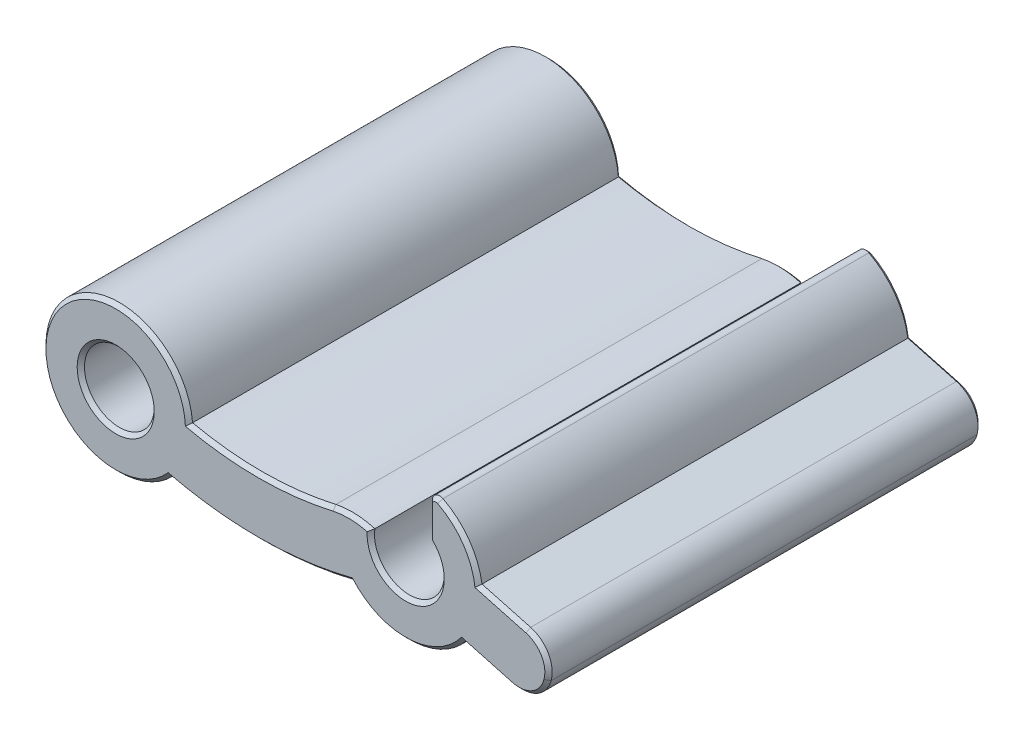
ISO-10303-21;
HEADER;
FILE_DESCRIPTION(('STEP AP214'),'2;1');
FILE_NAME('part.step','',(''),(''),'','','');
FILE_SCHEMA(('AUTOMOTIVE_DESIGN { 1 0 10303 214 1 1 1 1 }'));
ENDSEC;
DATA;
#1=APPLICATION_CONTEXT('core data for automotive mechanical design processes');
#2=APPLICATION_PROTOCOL_DEFINITION('international standard','automotive_design',2000,#1);
#3=PRODUCT_CONTEXT('',#1,'mechanical');
#4=PRODUCT('Part','Part','',(#3));
#5=PRODUCT_RELATED_PRODUCT_CATEGORY('part','',(#4));
#6=PRODUCT_DEFINITION_FORMATION('','',#4);
#7=PRODUCT_DEFINITION_CONTEXT('part definition',#1,'design');
#8=PRODUCT_DEFINITION('design','',#6,#7);
#9=PRODUCT_DEFINITION_SHAPE('','',#8);
#10=(LENGTH_UNIT() NAMED_UNIT(*) SI_UNIT(.MILLI.,.METRE.));
#11=(NAMED_UNIT(*) PLANE_ANGLE_UNIT() SI_UNIT($,.RADIAN.));
#12=(NAMED_UNIT(*) SI_UNIT($,.STERADIAN.) SOLID_ANGLE_UNIT());
#13=UNCERTAINTY_MEASURE_WITH_UNIT(LENGTH_MEASURE(1.E-05),#10,'distance_accuracy_value','');
#14=(GEOMETRIC_REPRESENTATION_CONTEXT(3) GLOBAL_UNCERTAINTY_ASSIGNED_CONTEXT((#13)) GLOBAL_UNIT_ASSIGNED_CONTEXT((#10,
#11,#12)) REPRESENTATION_CONTEXT('',''));
#15=CARTESIAN_POINT('',(0.,0.,0.));
#16=DIRECTION('',(0.,0.,1.));
#17=DIRECTION('',(1.,0.,0.));
#18=AXIS2_PLACEMENT_3D('',#15,#16,#17);
#19=CARTESIAN_POINT('',(66.3821386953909,-73.8159430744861,-23.6));
#20=DIRECTION('',(0.,0.,-1.));
#21=DIRECTION('',(-1.,0.,0.));
#22=AXIS2_PLACEMENT_3D('',#19,#20,#21);
#23=PLANE('',#22);
#24=CARTESIAN_POINT('',(58.60837752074,-91.5648192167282,-23.6));
#25=DIRECTION('',(0.,0.,-1.));
#26=DIRECTION('',(-1.,0.,0.));
#27=AXIS2_PLACEMENT_3D('',#24,#25,#26);
#28=CIRCLE('',#27,2.09999999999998);
#29=CARTESIAN_POINT('',(56.5083775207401,-91.5648192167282,-23.6));
#30=VERTEX_POINT('',#29);
#31=EDGE_CURVE('E11',#30,#30,#28,.F.);
#32=ORIENTED_EDGE('',*,*,#31,.T.);
#33=EDGE_LOOP('',(#32));
#34=FACE_BOUND('',#33,.T.);
#35=CARTESIAN_POINT('',(74.40837752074,-91.5648192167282,-23.6));
#36=DIRECTION('',(0.,0.,-1.));
#37=DIRECTION('',(-1.,0.,0.));
#38=AXIS2_PLACEMENT_3D('',#35,#36,#37);
#39=CIRCLE('',#38,2.1);
#40=CARTESIAN_POINT('',(72.3126935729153,-91.4302503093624,-23.6));
#41=VERTEX_POINT('',#40);
#42=CARTESIAN_POINT('',(75.8583775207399,-90.0457734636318,-23.6));
#43=VERTEX_POINT('',#42);
#44=EDGE_CURVE('E792',#41,#43,#39,.F.);
#45=ORIENTED_EDGE('',*,*,#44,.T.);
#46=DIRECTION('',(0.,1.,0.));
#47=VECTOR('',#46,1.);
#48=CARTESIAN_POINT('',(75.85837752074,-88.365209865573,-23.6));
#49=LINE('',#48,#47);
#50=CARTESIAN_POINT('',(75.85837752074,-88.365209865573,-23.6));
#51=VERTEX_POINT('',#50);
#52=EDGE_CURVE('E62',#43,#51,#49,.T.);
#53=ORIENTED_EDGE('',*,*,#52,.T.);
#54=CARTESIAN_POINT('',(76.05837752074,-88.365209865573,-23.6));
#55=DIRECTION('',(0.,0.,-1.));
#56=DIRECTION('',(-1.,0.,0.));
#57=AXIS2_PLACEMENT_3D('',#54,#55,#56);
#58=CIRCLE('',#57,0.199999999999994);
#59=CARTESIAN_POINT('',(76.1500441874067,-88.1874537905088,-23.6));
#60=VERTEX_POINT('',#59);
#61=EDGE_CURVE('E77',#51,#60,#58,.T.);
#62=ORIENTED_EDGE('',*,*,#61,.T.);
#63=CARTESIAN_POINT('',(74.40837752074,-91.5648192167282,-23.6));
#64=DIRECTION('',(0.,0.,-1.));
#65=DIRECTION('',(-1.,0.,0.));
#66=AXIS2_PLACEMENT_3D('',#63,#64,#65);
#67=CIRCLE('',#66,3.79999999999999);
#68=CARTESIAN_POINT('',(78.1839900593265,-91.1349937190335,-23.6));
#69=VERTEX_POINT('',#68);
#70=EDGE_CURVE('E807',#60,#69,#67,.T.);
#71=ORIENTED_EDGE('',*,*,#70,.T.);
#72=DIRECTION('',(0.965365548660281,-0.260901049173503,0.));
#73=VECTOR('',#72,1.);
#74=CARTESIAN_POINT('',(80.9616321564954,-91.8856831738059,-23.6));
#75=LINE('',#74,#73);
#76=CARTESIAN_POINT('',(80.9616321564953,-91.8856831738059,-23.6));
#77=VERTEX_POINT('',#76);
#78=EDGE_CURVE('E804',#69,#77,#75,.T.);
#79=ORIENTED_EDGE('',*,*,#78,.T.);
#80=CARTESIAN_POINT('',(80.5989796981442,-93.2275412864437,-23.6));
#81=DIRECTION('',(0.,0.,-1.));
#82=DIRECTION('',(-1.,0.,0.));
#83=AXIS2_PLACEMENT_3D('',#80,#81,#82);
#84=CIRCLE('',#83,1.39);
#85=CARTESIAN_POINT('',(81.940837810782,-93.5901937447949,-23.6));
#86=VERTEX_POINT('',#85);
#87=EDGE_CURVE('E801',#77,#86,#84,.T.);
#88=ORIENTED_EDGE('',*,*,#87,.T.);
#89=DIRECTION('',(-0.260901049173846,-0.965365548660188,0.));
#90=VECTOR('',#89,1.);
#91=CARTESIAN_POINT('',(81.9356197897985,-93.609501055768,-23.6));
#92=LINE('',#91,#90);
#93=CARTESIAN_POINT('',(81.9356197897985,-93.609501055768,-23.6));
#94=VERTEX_POINT('',#93);
#95=EDGE_CURVE('E798',#86,#94,#92,.T.);
#96=ORIENTED_EDGE('',*,*,#95,.T.);
#97=CARTESIAN_POINT('',(80.5937616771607,-93.2468485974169,-23.6));
#98=DIRECTION('',(0.,0.,-1.));
#99=DIRECTION('',(-1.,0.,0.));
#100=AXIS2_PLACEMENT_3D('',#97,#98,#99);
#101=CIRCLE('',#100,1.38999999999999);
#102=CARTESIAN_POINT('',(80.2311092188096,-94.5887067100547,-23.6));
#103=VERTEX_POINT('',#102);
#104=EDGE_CURVE('E795',#94,#103,#101,.T.);
#105=ORIENTED_EDGE('',*,*,#104,.T.);
#106=DIRECTION('',(-0.965365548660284,0.260901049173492,0.));
#107=VECTOR('',#106,1.);
#108=CARTESIAN_POINT('',(77.5822046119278,-93.8728100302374,-23.6));
#109=LINE('',#108,#107);
#110=CARTESIAN_POINT('',(77.4534671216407,-93.8380172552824,-23.6));
#111=VERTEX_POINT('',#110);
#112=EDGE_CURVE('E786',#103,#111,#109,.T.);
#113=ORIENTED_EDGE('',*,*,#112,.T.);
#114=CARTESIAN_POINT('',(74.40837752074,-91.5648192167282,-23.6));
#115=DIRECTION('',(0.,0.,-1.));
#116=DIRECTION('',(-1.,0.,0.));
#117=AXIS2_PLACEMENT_3D('',#114,#115,#116);
#118=CIRCLE('',#117,3.79999999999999);
#119=CARTESIAN_POINT('',(71.5069788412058,-94.0187722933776,-23.6));
#120=VERTEX_POINT('',#119);
#121=EDGE_CURVE('E281',#111,#120,#118,.T.);
#122=ORIENTED_EDGE('',*,*,#121,.T.);
#123=CARTESIAN_POINT('',(66.3821386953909,-73.8159430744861,-23.6));
#124=DIRECTION('',(0.,0.,-1.));
#125=DIRECTION('',(-1.,0.,0.));
#126=AXIS2_PLACEMENT_3D('',#123,#124,#125);
#127=CIRCLE('',#126,20.8427036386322);
#128=CARTESIAN_POINT('',(61.465309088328,-94.0704013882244,-23.6));
#129=VERTEX_POINT('',#128);
#130=EDGE_CURVE('E781',#120,#129,#127,.T.);
#131=ORIENTED_EDGE('',*,*,#130,.T.);
#132=CARTESIAN_POINT('',(58.60837752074,-91.5648192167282,-23.6));
#133=DIRECTION('',(0.,0.,-1.));
#134=DIRECTION('',(-1.,0.,0.));
#135=AXIS2_PLACEMENT_3D('',#132,#133,#134);
#136=CIRCLE('',#135,3.80000000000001);
#137=CARTESIAN_POINT('',(62.4054208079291,-91.4149450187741,-23.6));
#138=VERTEX_POINT('',#137);
#139=EDGE_CURVE('E778',#129,#138,#136,.T.);
#140=ORIENTED_EDGE('',*,*,#139,.T.);
#141=CARTESIAN_POINT('',(66.3821386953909,-73.8159430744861,-23.6));
#142=DIRECTION('',(0.,0.,-1.));
#143=DIRECTION('',(-1.,0.,0.));
#144=AXIS2_PLACEMENT_3D('',#141,#142,#143);
#145=CIRCLE('',#144,18.0427036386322);
#146=CARTESIAN_POINT('',(70.4513630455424,-91.3937861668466,-23.6));
#147=VERTEX_POINT('',#146);
#148=EDGE_CURVE('E775',#138,#147,#145,.F.);
#149=ORIENTED_EDGE('',*,*,#148,.T.);
#150=CARTESIAN_POINT('',(71.3023640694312,-95.478519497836,-23.6));
#151=DIRECTION('',(0.,0.,-1.));
#152=DIRECTION('',(-1.,0.,0.));
#153=AXIS2_PLACEMENT_3D('',#150,#151,#152);
#154=CIRCLE('',#153,4.17243922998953);
#155=EDGE_CURVE('E789',#147,#41,#154,.T.);
#156=ORIENTED_EDGE('',*,*,#155,.T.);
#157=EDGE_LOOP('',(#45,#53,#62,#71,#79,#88,#96,#105,#113,#122,#131,#140,#149,#156));
#158=FACE_BOUND('',#157,.T.);
#159=ADVANCED_FACE('F45',(#34,#158),#23,.T.);
#160=CARTESIAN_POINT('',(66.3821386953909,-73.8159430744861,0.));
#161=DIRECTION('',(0.,0.,-1.));
#162=DIRECTION('',(-1.,0.,0.));
#163=AXIS2_PLACEMENT_3D('',#160,#161,#162);
#164=PLANE('',#163);
#165=CARTESIAN_POINT('',(74.40837752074,-91.5648192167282,0.));
#166=DIRECTION('',(0.,0.,-1.));
#167=DIRECTION('',(-1.,0.,0.));
#168=AXIS2_PLACEMENT_3D('',#165,#166,#167);
#169=CIRCLE('',#168,3.8);
#170=CARTESIAN_POINT('',(71.5069788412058,-94.0187722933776,0.));
#171=VERTEX_POINT('',#170);
#172=CARTESIAN_POINT('',(77.4534671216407,-93.8380172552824,0.));
#173=VERTEX_POINT('',#172);
#174=EDGE_CURVE('E876',#171,#173,#169,.F.);
#175=ORIENTED_EDGE('',*,*,#174,.T.);
#176=DIRECTION('',(0.965365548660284,-0.260901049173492,0.));
#177=VECTOR('',#176,1.);
#178=CARTESIAN_POINT('',(62.092899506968,-89.6866486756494,0.));
#179=LINE('',#178,#177);
#180=CARTESIAN_POINT('',(80.2311092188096,-94.5887067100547,0.));
#181=VERTEX_POINT('',#180);
#182=EDGE_CURVE('E691',#173,#181,#179,.T.);
#183=ORIENTED_EDGE('',*,*,#182,.T.);
#184=CARTESIAN_POINT('',(80.5937616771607,-93.2468485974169,0.));
#185=DIRECTION('',(0.,0.,-1.));
#186=DIRECTION('',(-1.,0.,0.));
#187=AXIS2_PLACEMENT_3D('',#184,#185,#186);
#188=CIRCLE('',#187,1.39000000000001);
#189=CARTESIAN_POINT('',(81.9356197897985,-93.6095010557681,0.));
#190=VERTEX_POINT('',#189);
#191=EDGE_CURVE('E688',#181,#190,#188,.F.);
#192=ORIENTED_EDGE('',*,*,#191,.T.);
#193=DIRECTION('',(0.260901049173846,0.965365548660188,0.));
#194=VECTOR('',#193,1.);
#195=CARTESIAN_POINT('',(85.8622065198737,-79.0806535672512,0.));
#196=LINE('',#195,#194);
#197=CARTESIAN_POINT('',(81.940837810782,-93.5901937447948,0.));
#198=VERTEX_POINT('',#197);
#199=EDGE_CURVE('E685',#190,#198,#196,.T.);
#200=ORIENTED_EDGE('',*,*,#199,.T.);
#201=CARTESIAN_POINT('',(80.5989796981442,-93.2275412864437,0.));
#202=DIRECTION('',(0.,0.,-1.));
#203=DIRECTION('',(-1.,0.,0.));
#204=AXIS2_PLACEMENT_3D('',#201,#202,#203);
#205=CIRCLE('',#204,1.39);
#206=CARTESIAN_POINT('',(80.9616321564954,-91.8856831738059,0.));
#207=VERTEX_POINT('',#206);
#208=EDGE_CURVE('E677',#198,#207,#205,.F.);
#209=ORIENTED_EDGE('',*,*,#208,.T.);
#210=DIRECTION('',(-0.965365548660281,0.260901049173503,0.));
#211=VECTOR('',#210,1.);
#212=CARTESIAN_POINT('',(62.8234224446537,-86.9836251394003,0.));
#213=LINE('',#212,#211);
#214=CARTESIAN_POINT('',(78.1839900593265,-91.1349937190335,0.));
#215=VERTEX_POINT('',#214);
#216=EDGE_CURVE('E662',#207,#215,#213,.T.);
#217=ORIENTED_EDGE('',*,*,#216,.T.);
#218=CARTESIAN_POINT('',(74.40837752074,-91.5648192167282,0.));
#219=DIRECTION('',(0.,0.,-1.));
#220=DIRECTION('',(-1.,0.,0.));
#221=AXIS2_PLACEMENT_3D('',#218,#219,#220);
#222=CIRCLE('',#221,3.8);
#223=CARTESIAN_POINT('',(76.1500441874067,-88.1874537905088,0.));
#224=VERTEX_POINT('',#223);
#225=EDGE_CURVE('E669',#215,#224,#222,.F.);
#226=ORIENTED_EDGE('',*,*,#225,.T.);
#227=CARTESIAN_POINT('',(76.05837752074,-88.365209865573,0.));
#228=DIRECTION('',(0.,0.,-1.));
#229=DIRECTION('',(-1.,0.,0.));
#230=AXIS2_PLACEMENT_3D('',#227,#228,#229);
#231=CIRCLE('',#230,0.199999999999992);
#232=CARTESIAN_POINT('',(75.85837752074,-88.365209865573,0.));
#233=VERTEX_POINT('',#232);
#234=EDGE_CURVE('E673',#224,#233,#231,.F.);
#235=ORIENTED_EDGE('',*,*,#234,.T.);
#236=DIRECTION('',(0.,-1.,0.));
#237=VECTOR('',#236,1.);
#238=CARTESIAN_POINT('',(75.85837752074,-73.8159430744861,0.));
#239=LINE('',#238,#237);
#240=CARTESIAN_POINT('',(75.8583775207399,-90.0457734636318,0.));
#241=VERTEX_POINT('',#240);
#242=EDGE_CURVE('E679',#233,#241,#239,.T.);
#243=ORIENTED_EDGE('',*,*,#242,.T.);
#244=CARTESIAN_POINT('',(74.40837752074,-91.5648192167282,0.));
#245=DIRECTION('',(0.,0.,-1.));
#246=DIRECTION('',(-1.,0.,0.));
#247=AXIS2_PLACEMENT_3D('',#244,#245,#246);
#248=CIRCLE('',#247,2.1);
#249=CARTESIAN_POINT('',(72.3126935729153,-91.4302503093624,0.));
#250=VERTEX_POINT('',#249);
#251=EDGE_CURVE('E873',#241,#250,#248,.T.);
#252=ORIENTED_EDGE('',*,*,#251,.T.);
#253=CARTESIAN_POINT('',(71.3023640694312,-95.478519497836,0.));
#254=DIRECTION('',(0.,0.,-1.));
#255=DIRECTION('',(-1.,0.,0.));
#256=AXIS2_PLACEMENT_3D('',#253,#254,#255);
#257=CIRCLE('',#256,4.17243922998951);
#258=CARTESIAN_POINT('',(70.4513630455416,-91.3937861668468,0.));
#259=VERTEX_POINT('',#258);
#260=EDGE_CURVE('E870',#250,#259,#257,.F.);
#261=ORIENTED_EDGE('',*,*,#260,.T.);
#262=CARTESIAN_POINT('',(66.3821386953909,-73.8159430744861,0.));
#263=DIRECTION('',(0.,0.,-1.));
#264=DIRECTION('',(-1.,0.,0.));
#265=AXIS2_PLACEMENT_3D('',#262,#263,#264);
#266=CIRCLE('',#265,18.0427036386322);
#267=CARTESIAN_POINT('',(62.4054208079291,-91.4149450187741,0.));
#268=VERTEX_POINT('',#267);
#269=EDGE_CURVE('E864',#259,#268,#266,.T.);
#270=ORIENTED_EDGE('',*,*,#269,.T.);
#271=CARTESIAN_POINT('',(58.60837752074,-91.5648192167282,0.));
#272=DIRECTION('',(0.,0.,-1.));
#273=DIRECTION('',(-1.,0.,0.));
#274=AXIS2_PLACEMENT_3D('',#271,#272,#273);
#275=CIRCLE('',#274,3.8);
#276=CARTESIAN_POINT('',(61.465309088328,-94.0704013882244,0.));
#277=VERTEX_POINT('',#276);
#278=EDGE_CURVE('E861',#268,#277,#275,.F.);
#279=ORIENTED_EDGE('',*,*,#278,.T.);
#280=CARTESIAN_POINT('',(66.3821386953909,-73.8159430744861,0.));
#281=DIRECTION('',(0.,0.,-1.));
#282=DIRECTION('',(-1.,0.,0.));
#283=AXIS2_PLACEMENT_3D('',#280,#281,#282);
#284=CIRCLE('',#283,20.8427036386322);
#285=EDGE_CURVE('E867',#277,#171,#284,.F.);
#286=ORIENTED_EDGE('',*,*,#285,.T.);
#287=EDGE_LOOP('',(#175,#183,#192,#200,#209,#217,#226,#235,#243,#252,#261,#270,#279,#286));
#288=FACE_BOUND('',#287,.T.);
#289=CARTESIAN_POINT('',(58.60837752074,-91.5648192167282,0.));
#290=DIRECTION('',(0.,0.,-1.));
#291=DIRECTION('',(-1.,0.,0.));
#292=AXIS2_PLACEMENT_3D('',#289,#290,#291);
#293=CIRCLE('',#292,2.1);
#294=CARTESIAN_POINT('',(56.50837752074,-91.5648192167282,0.));
#295=VERTEX_POINT('',#294);
#296=EDGE_CURVE('E857',#295,#295,#293,.T.);
#297=ORIENTED_EDGE('',*,*,#296,.T.);
#298=EDGE_LOOP('',(#297));
#299=FACE_BOUND('',#298,.T.);
#300=ADVANCED_FACE('F475',(#288,#299),#164,.F.);
#301=CARTESIAN_POINT('',(66.3821386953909,-73.8159430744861,-23.6));
#302=DIRECTION('',(0.,0.,1.));
#303=DIRECTION('',(1.,0.,0.));
#304=AXIS2_PLACEMENT_3D('',#301,#302,#303);
#305=CYLINDRICAL_SURFACE('',#304,21.0427036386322);
#306=DIRECTION('',(0.,0.,1.));
#307=VECTOR('',#306,1.);
#308=CARTESIAN_POINT('',(71.4368619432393,-94.242522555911,-23.6));
#309=LINE('',#308,#307);
#310=CARTESIAN_POINT('',(71.4368619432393,-94.242522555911,-23.4));
#311=VERTEX_POINT('',#310);
#312=CARTESIAN_POINT('',(71.4368619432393,-94.242522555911,-0.200000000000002));
#313=VERTEX_POINT('',#312);
#314=EDGE_CURVE('E248',#311,#313,#309,.T.);
#315=ORIENTED_EDGE('',*,*,#314,.T.);
#316=CARTESIAN_POINT('',(66.3821386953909,-73.8159430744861,-0.200000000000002));
#317=DIRECTION('',(0.,0.,-1.));
#318=DIRECTION('',(-1.,0.,0.));
#319=AXIS2_PLACEMENT_3D('',#316,#317,#318);
#320=CIRCLE('',#319,21.0427036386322);
#321=CARTESIAN_POINT('',(61.5340398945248,-94.2925471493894,-0.200000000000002));
#322=VERTEX_POINT('',#321);
#323=EDGE_CURVE('E752',#313,#322,#320,.T.);
#324=ORIENTED_EDGE('',*,*,#323,.T.);
#325=DIRECTION('',(0.,0.,1.));
#326=VECTOR('',#325,1.);
#327=CARTESIAN_POINT('',(61.5340398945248,-94.2925471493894,-23.6));
#328=LINE('',#327,#326);
#329=CARTESIAN_POINT('',(61.5340398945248,-94.2925471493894,-23.4));
#330=VERTEX_POINT('',#329);
#331=EDGE_CURVE('E845',#330,#322,#328,.T.);
#332=ORIENTED_EDGE('',*,*,#331,.F.);
#333=CARTESIAN_POINT('',(66.3821386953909,-73.8159430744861,-23.4));
#334=DIRECTION('',(0.,0.,-1.));
#335=DIRECTION('',(-1.,0.,0.));
#336=AXIS2_PLACEMENT_3D('',#333,#334,#335);
#337=CIRCLE('',#336,21.0427036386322);
#338=EDGE_CURVE('E749',#330,#311,#337,.F.);
#339=ORIENTED_EDGE('',*,*,#338,.T.);
#340=EDGE_LOOP('',(#315,#324,#332,#339));
#341=FACE_BOUND('',#340,.T.);
#342=ADVANCED_FACE('F481',(#341),#305,.T.);
#343=CARTESIAN_POINT('',(58.60837752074,-91.5648192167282,-23.6));
#344=DIRECTION('',(0.,0.,1.));
#345=DIRECTION('',(1.,0.,0.));
#346=AXIS2_PLACEMENT_3D('',#343,#344,#345);
#347=CYLINDRICAL_SURFACE('',#346,4.00000000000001);
#348=ORIENTED_EDGE('',*,*,#331,.T.);
#349=CARTESIAN_POINT('',(58.60837752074,-91.5648192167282,-0.200000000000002));
#350=DIRECTION('',(0.,0.,-1.));
#351=DIRECTION('',(-1.,0.,0.));
#352=AXIS2_PLACEMENT_3D('',#349,#350,#351);
#353=CIRCLE('',#352,4.00000000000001);
#354=CARTESIAN_POINT('',(62.5961544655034,-91.2523531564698,-0.200000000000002));
#355=VERTEX_POINT('',#354);
#356=EDGE_CURVE('E764',#322,#355,#353,.T.);
#357=ORIENTED_EDGE('',*,*,#356,.T.);
#358=DIRECTION('',(0.,0.,1.));
#359=VECTOR('',#358,1.);
#360=CARTESIAN_POINT('',(62.5961544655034,-91.2523531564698,-23.6));
#361=LINE('',#360,#359);
#362=CARTESIAN_POINT('',(62.5961544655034,-91.2523531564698,-23.4));
#363=VERTEX_POINT('',#362);
#364=EDGE_CURVE('E841',#363,#355,#361,.T.);
#365=ORIENTED_EDGE('',*,*,#364,.F.);
#366=CARTESIAN_POINT('',(58.60837752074,-91.5648192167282,-23.4));
#367=DIRECTION('',(0.,0.,-1.));
#368=DIRECTION('',(-1.,0.,0.));
#369=AXIS2_PLACEMENT_3D('',#366,#367,#368);
#370=CIRCLE('',#369,4.00000000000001);
#371=EDGE_CURVE('E761',#363,#330,#370,.F.);
#372=ORIENTED_EDGE('',*,*,#371,.T.);
#373=EDGE_LOOP('',(#348,#357,#365,#372));
#374=FACE_BOUND('',#373,.T.);
#375=ADVANCED_FACE('F526',(#374),#347,.T.);
#376=CARTESIAN_POINT('',(66.3821386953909,-73.8159430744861,-23.6));
#377=DIRECTION('',(0.,0.,1.));
#378=DIRECTION('',(1.,0.,0.));
#379=AXIS2_PLACEMENT_3D('',#376,#377,#378);
#380=CYLINDRICAL_SURFACE('',#379,17.8427036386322);
#381=ORIENTED_EDGE('',*,*,#364,.T.);
#382=CARTESIAN_POINT('',(66.3821386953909,-73.8159430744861,-0.200000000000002));
#383=DIRECTION('',(0.,0.,-1.));
#384=DIRECTION('',(-1.,0.,0.));
#385=AXIS2_PLACEMENT_3D('',#382,#383,#384);
#386=CIRCLE('',#385,17.8427036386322);
#387=CARTESIAN_POINT('',(70.40837752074,-91.1984479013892,-0.200000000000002));
#388=VERTEX_POINT('',#387);
#389=EDGE_CURVE('E758',#355,#388,#386,.F.);
#390=ORIENTED_EDGE('',*,*,#389,.T.);
#391=DIRECTION('',(0.,0.,1.));
#392=VECTOR('',#391,1.);
#393=CARTESIAN_POINT('',(70.40837752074,-91.1984479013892,-23.6));
#394=LINE('',#393,#392);
#395=CARTESIAN_POINT('',(70.40837752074,-91.1984479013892,-23.4));
#396=VERTEX_POINT('',#395);
#397=EDGE_CURVE('E831',#396,#388,#394,.T.);
#398=ORIENTED_EDGE('',*,*,#397,.F.);
#399=CARTESIAN_POINT('',(66.3821386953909,-73.8159430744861,-23.4));
#400=DIRECTION('',(0.,0.,-1.));
#401=DIRECTION('',(-1.,0.,0.));
#402=AXIS2_PLACEMENT_3D('',#399,#400,#401);
#403=CIRCLE('',#402,17.8427036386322);
#404=EDGE_CURVE('E755',#396,#363,#403,.T.);
#405=ORIENTED_EDGE('',*,*,#404,.T.);
#406=EDGE_LOOP('',(#381,#390,#398,#405));
#407=FACE_BOUND('',#406,.T.);
#408=ADVANCED_FACE('F522',(#407),#380,.F.);
#409=CARTESIAN_POINT('',(71.3023640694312,-95.478519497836,-23.6));
#410=DIRECTION('',(0.,0.,1.));
#411=DIRECTION('',(1.,0.,0.));
#412=AXIS2_PLACEMENT_3D('',#409,#410,#411);
#413=CYLINDRICAL_SURFACE('',#412,4.37243922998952);
#414=ORIENTED_EDGE('',*,*,#397,.T.);
#415=CARTESIAN_POINT('',(71.3023640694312,-95.478519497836,-0.200000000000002));
#416=DIRECTION('',(0.,0.,-1.));
#417=DIRECTION('',(-1.,0.,0.));
#418=AXIS2_PLACEMENT_3D('',#415,#416,#417);
#419=CIRCLE('',#418,4.37243922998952);
#420=CARTESIAN_POINT('',(72.5295699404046,-91.2818314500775,-0.200000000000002));
#421=VERTEX_POINT('',#420);
#422=EDGE_CURVE('E746',#388,#421,#419,.T.);
#423=ORIENTED_EDGE('',*,*,#422,.T.);
#424=DIRECTION('',(0.,0.,1.));
#425=VECTOR('',#424,1.);
#426=CARTESIAN_POINT('',(72.5295699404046,-91.2818314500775,-23.6));
#427=LINE('',#426,#425);
#428=CARTESIAN_POINT('',(72.5295699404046,-91.2818314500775,-23.4));
#429=VERTEX_POINT('',#428);
#430=EDGE_CURVE('E826',#429,#421,#427,.T.);
#431=ORIENTED_EDGE('',*,*,#430,.F.);
#432=CARTESIAN_POINT('',(71.3023640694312,-95.478519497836,-23.4));
#433=DIRECTION('',(0.,0.,-1.));
#434=DIRECTION('',(-1.,0.,0.));
#435=AXIS2_PLACEMENT_3D('',#432,#433,#434);
#436=CIRCLE('',#435,4.37243922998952);
#437=EDGE_CURVE('E743',#429,#396,#436,.F.);
#438=ORIENTED_EDGE('',*,*,#437,.T.);
#439=EDGE_LOOP('',(#414,#423,#431,#438));
#440=FACE_BOUND('',#439,.T.);
#441=ADVANCED_FACE('F518',(#440),#413,.T.);
#442=CARTESIAN_POINT('',(74.40837752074,-91.5648192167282,-23.6));
#443=DIRECTION('',(0.,0.,1.));
#444=DIRECTION('',(1.,0.,0.));
#445=AXIS2_PLACEMENT_3D('',#442,#443,#444);
#446=CYLINDRICAL_SURFACE('',#445,1.9);
#447=ORIENTED_EDGE('',*,*,#430,.T.);
#448=CARTESIAN_POINT('',(74.40837752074,-91.5648192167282,-0.200000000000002));
#449=DIRECTION('',(0.,0.,-1.));
#450=DIRECTION('',(-1.,0.,0.));
#451=AXIS2_PLACEMENT_3D('',#448,#449,#450);
#452=CIRCLE('',#451,1.9);
#453=CARTESIAN_POINT('',(75.65837752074,-90.1339104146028,-0.200000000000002));
#454=VERTEX_POINT('',#453);
#455=EDGE_CURVE('E740',#421,#454,#452,.F.);
#456=ORIENTED_EDGE('',*,*,#455,.T.);
#457=DIRECTION('',(0.,0.,1.));
#458=VECTOR('',#457,1.);
#459=CARTESIAN_POINT('',(75.65837752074,-90.1339104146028,-23.6));
#460=LINE('',#459,#458);
#461=CARTESIAN_POINT('',(75.65837752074,-90.1339104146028,-23.4));
#462=VERTEX_POINT('',#461);
#463=EDGE_CURVE('E821',#462,#454,#460,.T.);
#464=ORIENTED_EDGE('',*,*,#463,.F.);
#465=CARTESIAN_POINT('',(74.40837752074,-91.5648192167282,-23.4));
#466=DIRECTION('',(0.,0.,-1.));
#467=DIRECTION('',(-1.,0.,0.));
#468=AXIS2_PLACEMENT_3D('',#465,#466,#467);
#469=CIRCLE('',#468,1.9);
#470=EDGE_CURVE('E737',#462,#429,#469,.T.);
#471=ORIENTED_EDGE('',*,*,#470,.T.);
#472=EDGE_LOOP('',(#447,#456,#464,#471));
#473=FACE_BOUND('',#472,.T.);
#474=ADVANCED_FACE('F514',(#473),#446,.F.);
#475=CARTESIAN_POINT('',(75.65837752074,-87.7651481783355,-23.6));
#476=DIRECTION('',(1.,0.,0.));
#477=DIRECTION('',(0.,0.,-1.));
#478=AXIS2_PLACEMENT_3D('',#475,#476,#477);
#479=PLANE('',#478);
#480=ORIENTED_EDGE('',*,*,#463,.T.);
#481=DIRECTION('',(0.,1.,0.));
#482=VECTOR('',#481,1.);
#483=CARTESIAN_POINT('',(75.65837752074,-87.7651481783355,-0.200000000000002));
#484=LINE('',#483,#482);
#485=CARTESIAN_POINT('',(75.65837752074,-88.365209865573,-0.200000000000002));
#486=VERTEX_POINT('',#485);
#487=EDGE_CURVE('E255',#454,#486,#484,.T.);
#488=ORIENTED_EDGE('',*,*,#487,.T.);
#489=DIRECTION('',(0.,0.,1.));
#490=VECTOR('',#489,1.);
#491=CARTESIAN_POINT('',(75.65837752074,-88.365209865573,-23.6));
#492=LINE('',#491,#490);
#493=CARTESIAN_POINT('',(75.65837752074,-88.365209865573,-23.4));
#494=VERTEX_POINT('',#493);
#495=EDGE_CURVE('E278',#486,#494,#492,.F.);
#496=ORIENTED_EDGE('',*,*,#495,.T.);
#497=DIRECTION('',(0.,-1.,0.));
#498=VECTOR('',#497,1.);
#499=CARTESIAN_POINT('',(75.65837752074,-90.1339104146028,-23.4));
#500=LINE('',#499,#498);
#501=EDGE_CURVE('E729',#494,#462,#500,.T.);
#502=ORIENTED_EDGE('',*,*,#501,.T.);
#503=EDGE_LOOP('',(#480,#488,#496,#502));
#504=FACE_BOUND('',#503,.T.);
#505=ADVANCED_FACE('F510',(#504),#479,.F.);
#506=CARTESIAN_POINT('',(74.40837752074,-91.5648192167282,-23.6));
#507=DIRECTION('',(0.,0.,1.));
#508=DIRECTION('',(1.,0.,0.));
#509=AXIS2_PLACEMENT_3D('',#506,#507,#508);
#510=CYLINDRICAL_SURFACE('',#509,4.);
#511=DIRECTION('',(0.,0.,1.));
#512=VECTOR('',#511,1.);
#513=CARTESIAN_POINT('',(76.2417108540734,-88.0096977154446,-23.6));
#514=LINE('',#513,#512);
#515=CARTESIAN_POINT('',(76.2417108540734,-88.0096977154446,-23.4));
#516=VERTEX_POINT('',#515);
#517=CARTESIAN_POINT('',(76.2417108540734,-88.0096977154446,-0.200000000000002));
#518=VERTEX_POINT('',#517);
#519=EDGE_CURVE('E849',#516,#518,#514,.T.);
#520=ORIENTED_EDGE('',*,*,#519,.T.);
#521=CARTESIAN_POINT('',(74.40837752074,-91.5648192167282,-0.200000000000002));
#522=DIRECTION('',(0.,0.,-1.));
#523=DIRECTION('',(-1.,0.,0.));
#524=AXIS2_PLACEMENT_3D('',#521,#522,#523);
#525=CIRCLE('',#524,4.);
#526=CARTESIAN_POINT('',(78.3649077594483,-90.9767133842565,-0.200000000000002));
#527=VERTEX_POINT('',#526);
#528=EDGE_CURVE('E668',#518,#527,#525,.T.);
#529=ORIENTED_EDGE('',*,*,#528,.T.);
#530=DIRECTION('',(0.,0.,1.));
#531=VECTOR('',#530,1.);
#532=CARTESIAN_POINT('',(78.3649077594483,-90.9767133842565,-23.6));
#533=LINE('',#532,#531);
#534=CARTESIAN_POINT('',(78.3649077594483,-90.9767133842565,-23.4));
#535=VERTEX_POINT('',#534);
#536=EDGE_CURVE('E827',#535,#527,#533,.T.);
#537=ORIENTED_EDGE('',*,*,#536,.F.);
#538=CARTESIAN_POINT('',(74.40837752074,-91.5648192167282,-23.4));
#539=DIRECTION('',(0.,0.,-1.));
#540=DIRECTION('',(-1.,0.,0.));
#541=AXIS2_PLACEMENT_3D('',#538,#539,#540);
#542=CIRCLE('',#541,4.);
#543=EDGE_CURVE('E718',#535,#516,#542,.F.);
#544=ORIENTED_EDGE('',*,*,#543,.T.);
#545=EDGE_LOOP('',(#520,#529,#537,#544));
#546=FACE_BOUND('',#545,.T.);
#547=ADVANCED_FACE('F506',(#546),#510,.T.);
#548=CARTESIAN_POINT('',(81.01381236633,-91.6926100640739,-23.6));
#549=DIRECTION('',(-0.260901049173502,-0.965365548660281,0.));
#550=DIRECTION('',(0.965365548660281,-0.260901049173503,0.));
#551=AXIS2_PLACEMENT_3D('',#548,#549,#550);
#552=PLANE('',#551);
#553=ORIENTED_EDGE('',*,*,#536,.T.);
#554=DIRECTION('',(0.965365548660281,-0.260901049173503,0.));
#555=VECTOR('',#554,1.);
#556=CARTESIAN_POINT('',(81.01381236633,-91.6926100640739,-0.199999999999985));
#557=LINE('',#556,#555);
#558=CARTESIAN_POINT('',(81.01381236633,-91.6926100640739,-0.199999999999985));
#559=VERTEX_POINT('',#558);
#560=EDGE_CURVE('E664',#527,#559,#557,.T.);
#561=ORIENTED_EDGE('',*,*,#560,.T.);
#562=DIRECTION('',(0.,0.,1.));
#563=VECTOR('',#562,1.);
#564=CARTESIAN_POINT('',(81.01381236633,-91.6926100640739,-23.6));
#565=LINE('',#564,#563);
#566=CARTESIAN_POINT('',(81.01381236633,-91.6926100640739,-23.4));
#567=VERTEX_POINT('',#566);
#568=EDGE_CURVE('E834',#567,#559,#565,.T.);
#569=ORIENTED_EDGE('',*,*,#568,.F.);
#570=DIRECTION('',(-0.965365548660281,0.260901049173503,0.));
#571=VECTOR('',#570,1.);
#572=CARTESIAN_POINT('',(78.3649077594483,-90.9767133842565,-23.4));
#573=LINE('',#572,#571);
#574=EDGE_CURVE('E713',#567,#535,#573,.T.);
#575=ORIENTED_EDGE('',*,*,#574,.T.);
#576=EDGE_LOOP('',(#553,#561,#569,#575));
#577=FACE_BOUND('',#576,.T.);
#578=ADVANCED_FACE('F502',(#577),#552,.F.);
#579=CARTESIAN_POINT('',(80.5989796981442,-93.2275412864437,-23.6));
#580=DIRECTION('',(0.,0.,1.));
#581=DIRECTION('',(1.,0.,0.));
#582=AXIS2_PLACEMENT_3D('',#579,#580,#581);
#583=CYLINDRICAL_SURFACE('',#582,1.58999999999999);
#584=ORIENTED_EDGE('',*,*,#568,.T.);
#585=CARTESIAN_POINT('',(80.5989796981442,-93.2275412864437,-0.199999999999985));
#586=DIRECTION('',(0.,0.,-1.));
#587=DIRECTION('',(-1.,0.,0.));
#588=AXIS2_PLACEMENT_3D('',#585,#586,#587);
#589=CIRCLE('',#588,1.58999999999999);
#590=CARTESIAN_POINT('',(82.133910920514,-93.6423739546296,-0.199999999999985));
#591=VERTEX_POINT('',#590);
#592=EDGE_CURVE('E710',#559,#591,#589,.T.);
#593=ORIENTED_EDGE('',*,*,#592,.T.);
#594=DIRECTION('',(0.,0.,1.));
#595=VECTOR('',#594,1.);
#596=CARTESIAN_POINT('',(82.133910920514,-93.6423739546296,-23.6));
#597=LINE('',#596,#595);
#598=CARTESIAN_POINT('',(82.133910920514,-93.6423739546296,-23.4));
#599=VERTEX_POINT('',#598);
#600=EDGE_CURVE('E913',#599,#591,#597,.T.);
#601=ORIENTED_EDGE('',*,*,#600,.F.);
#602=CARTESIAN_POINT('',(80.5989796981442,-93.2275412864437,-23.4));
#603=DIRECTION('',(0.,0.,-1.));
#604=DIRECTION('',(-1.,0.,0.));
#605=AXIS2_PLACEMENT_3D('',#602,#603,#604);
#606=CIRCLE('',#605,1.58999999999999);
#607=EDGE_CURVE('E707',#599,#567,#606,.F.);
#608=ORIENTED_EDGE('',*,*,#607,.T.);
#609=EDGE_LOOP('',(#584,#593,#601,#608));
#610=FACE_BOUND('',#609,.T.);
#611=ADVANCED_FACE('F498',(#610),#583,.T.);
#612=CARTESIAN_POINT('',(82.133910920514,-93.6423739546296,-23.6));
#613=DIRECTION('',(-0.965365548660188,0.260901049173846,0.));
#614=DIRECTION('',(-0.260901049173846,-0.965365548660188,0.));
#615=AXIS2_PLACEMENT_3D('',#612,#613,#614);
#616=PLANE('',#615);
#617=ORIENTED_EDGE('',*,*,#600,.T.);
#618=DIRECTION('',(-0.260901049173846,-0.965365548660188,0.));
#619=VECTOR('',#618,1.);
#620=CARTESIAN_POINT('',(82.133910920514,-93.6423739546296,-0.199999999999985));
#621=LINE('',#620,#619);
#622=CARTESIAN_POINT('',(82.1286928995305,-93.6616812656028,-0.199999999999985));
#623=VERTEX_POINT('',#622);
#624=EDGE_CURVE('E704',#591,#623,#621,.T.);
#625=ORIENTED_EDGE('',*,*,#624,.T.);
#626=DIRECTION('',(0.,0.,1.));
#627=VECTOR('',#626,1.);
#628=CARTESIAN_POINT('',(82.1286928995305,-93.6616812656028,-23.6));
#629=LINE('',#628,#627);
#630=CARTESIAN_POINT('',(82.1286928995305,-93.6616812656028,-23.4));
#631=VERTEX_POINT('',#630);
#632=EDGE_CURVE('E909',#631,#623,#629,.T.);
#633=ORIENTED_EDGE('',*,*,#632,.F.);
#634=DIRECTION('',(0.260901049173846,0.965365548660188,0.));
#635=VECTOR('',#634,1.);
#636=CARTESIAN_POINT('',(82.133910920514,-93.6423739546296,-23.4));
#637=LINE('',#636,#635);
#638=EDGE_CURVE('E701',#631,#599,#637,.T.);
#639=ORIENTED_EDGE('',*,*,#638,.T.);
#640=EDGE_LOOP('',(#617,#625,#633,#639));
#641=FACE_BOUND('',#640,.T.);
#642=ADVANCED_FACE('F494',(#641),#616,.F.);
#643=CARTESIAN_POINT('',(80.5937616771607,-93.2468485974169,-23.6));
#644=DIRECTION('',(0.,0.,1.));
#645=DIRECTION('',(1.,0.,0.));
#646=AXIS2_PLACEMENT_3D('',#643,#644,#645);
#647=CYLINDRICAL_SURFACE('',#646,1.59);
#648=ORIENTED_EDGE('',*,*,#632,.T.);
#649=CARTESIAN_POINT('',(80.5937616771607,-93.2468485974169,-0.199999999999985));
#650=DIRECTION('',(0.,0.,-1.));
#651=DIRECTION('',(-1.,0.,0.));
#652=AXIS2_PLACEMENT_3D('',#649,#650,#651);
#653=CIRCLE('',#652,1.59);
#654=CARTESIAN_POINT('',(80.1789290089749,-94.7817798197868,-0.199999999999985));
#655=VERTEX_POINT('',#654);
#656=EDGE_CURVE('E698',#623,#655,#653,.T.);
#657=ORIENTED_EDGE('',*,*,#656,.T.);
#658=DIRECTION('',(0.,0.,1.));
#659=VECTOR('',#658,1.);
#660=CARTESIAN_POINT('',(80.1789290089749,-94.7817798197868,-23.6));
#661=LINE('',#660,#659);
#662=CARTESIAN_POINT('',(80.1789290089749,-94.7817798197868,-23.4));
#663=VERTEX_POINT('',#662);
#664=EDGE_CURVE('E267',#663,#655,#661,.T.);
#665=ORIENTED_EDGE('',*,*,#664,.F.);
#666=CARTESIAN_POINT('',(80.5937616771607,-93.2468485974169,-23.4));
#667=DIRECTION('',(0.,0.,-1.));
#668=DIRECTION('',(-1.,0.,0.));
#669=AXIS2_PLACEMENT_3D('',#666,#667,#668);
#670=CIRCLE('',#669,1.59);
#671=EDGE_CURVE('E695',#663,#631,#670,.F.);
#672=ORIENTED_EDGE('',*,*,#671,.T.);
#673=EDGE_LOOP('',(#648,#657,#665,#672));
#674=FACE_BOUND('',#673,.T.);
#675=ADVANCED_FACE('F491',(#674),#647,.T.);
#676=CARTESIAN_POINT('',(80.1789290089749,-94.7817798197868,-23.6));
#677=DIRECTION('',(0.260901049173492,0.965365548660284,0.));
#678=DIRECTION('',(-0.965365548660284,0.260901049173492,0.));
#679=AXIS2_PLACEMENT_3D('',#676,#677,#678);
#680=PLANE('',#679);
#681=ORIENTED_EDGE('',*,*,#664,.T.);
#682=DIRECTION('',(-0.965365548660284,0.260901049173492,0.));
#683=VECTOR('',#682,1.);
#684=CARTESIAN_POINT('',(80.1789290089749,-94.7817798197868,-0.199999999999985));
#685=LINE('',#684,#683);
#686=CARTESIAN_POINT('',(77.5300244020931,-94.0658831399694,-0.200000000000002));
#687=VERTEX_POINT('',#686);
#688=EDGE_CURVE('E265',#655,#687,#685,.T.);
#689=ORIENTED_EDGE('',*,*,#688,.T.);
#690=DIRECTION('',(0.,0.,1.));
#691=VECTOR('',#690,1.);
#692=CARTESIAN_POINT('',(77.5300244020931,-94.0658831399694,-23.6));
#693=LINE('',#692,#691);
#694=CARTESIAN_POINT('',(77.5300244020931,-94.0658831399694,-23.4));
#695=VERTEX_POINT('',#694);
#696=EDGE_CURVE('E246',#695,#687,#693,.T.);
#697=ORIENTED_EDGE('',*,*,#696,.F.);
#698=DIRECTION('',(0.965365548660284,-0.260901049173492,0.));
#699=VECTOR('',#698,1.);
#700=CARTESIAN_POINT('',(80.1789290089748,-94.7817798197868,-23.4));
#701=LINE('',#700,#699);
#702=EDGE_CURVE('E262',#695,#663,#701,.T.);
#703=ORIENTED_EDGE('',*,*,#702,.T.);
#704=EDGE_LOOP('',(#681,#689,#697,#703));
#705=FACE_BOUND('',#704,.T.);
#706=ADVANCED_FACE('F261',(#705),#680,.F.);
#707=CARTESIAN_POINT('',(74.40837752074,-91.5648192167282,-23.6));
#708=DIRECTION('',(0.,0.,1.));
#709=DIRECTION('',(1.,0.,0.));
#710=AXIS2_PLACEMENT_3D('',#707,#708,#709);
#711=CYLINDRICAL_SURFACE('',#710,3.99999999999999);
#712=ORIENTED_EDGE('',*,*,#696,.T.);
#713=CARTESIAN_POINT('',(74.40837752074,-91.5648192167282,-0.200000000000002));
#714=DIRECTION('',(0.,0.,-1.));
#715=DIRECTION('',(-1.,0.,0.));
#716=AXIS2_PLACEMENT_3D('',#713,#714,#715);
#717=CIRCLE('',#716,3.99999999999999);
#718=EDGE_CURVE('E254',#687,#313,#717,.T.);
#719=ORIENTED_EDGE('',*,*,#718,.T.);
#720=ORIENTED_EDGE('',*,*,#314,.F.);
#721=CARTESIAN_POINT('',(74.40837752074,-91.5648192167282,-23.4));
#722=DIRECTION('',(0.,0.,-1.));
#723=DIRECTION('',(-1.,0.,0.));
#724=AXIS2_PLACEMENT_3D('',#721,#722,#723);
#725=CIRCLE('',#724,3.99999999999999);
#726=EDGE_CURVE('E243',#311,#695,#725,.F.);
#727=ORIENTED_EDGE('',*,*,#726,.T.);
#728=EDGE_LOOP('',(#712,#719,#720,#727));
#729=FACE_BOUND('',#728,.T.);
#730=ADVANCED_FACE('F245',(#729),#711,.T.);
#731=CARTESIAN_POINT('',(58.60837752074,-91.5648192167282,-23.6));
#732=DIRECTION('',(0.,0.,1.));
#733=DIRECTION('',(1.,0.,0.));
#734=AXIS2_PLACEMENT_3D('',#731,#732,#733);
#735=CYLINDRICAL_SURFACE('',#734,1.89999999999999);
#736=CARTESIAN_POINT('',(58.60837752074,-91.5648192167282,-0.199999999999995));
#737=DIRECTION('',(0.,0.,-1.));
#738=DIRECTION('',(-1.,0.,0.));
#739=AXIS2_PLACEMENT_3D('',#736,#737,#738);
#740=CIRCLE('',#739,1.89999999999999);
#741=CARTESIAN_POINT('',(56.70837752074,-91.5648192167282,-0.199999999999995));
#742=VERTEX_POINT('',#741);
#743=EDGE_CURVE('E771',#742,#742,#740,.F.);
#744=ORIENTED_EDGE('',*,*,#743,.T.);
#745=EDGE_LOOP('',(#744));
#746=FACE_BOUND('',#745,.T.);
#747=CARTESIAN_POINT('',(58.60837752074,-91.5648192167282,-23.4));
#748=DIRECTION('',(0.,0.,-1.));
#749=DIRECTION('',(-1.,0.,0.));
#750=AXIS2_PLACEMENT_3D('',#747,#748,#749);
#751=CIRCLE('',#750,1.89999999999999);
#752=CARTESIAN_POINT('',(56.70837752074,-91.5648192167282,-23.4));
#753=VERTEX_POINT('',#752);
#754=EDGE_CURVE('E767',#753,#753,#751,.T.);
#755=ORIENTED_EDGE('',*,*,#754,.T.);
#756=EDGE_LOOP('',(#755));
#757=FACE_BOUND('',#756,.T.);
#758=ADVANCED_FACE('F485',(#746,#757),#735,.F.);
#759=CARTESIAN_POINT('',(76.05837752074,-88.365209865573,-23.6));
#760=DIRECTION('',(0.,0.,1.));
#761=DIRECTION('',(1.,0.,0.));
#762=AXIS2_PLACEMENT_3D('',#759,#760,#761);
#763=CYLINDRICAL_SURFACE('',#762,0.4);
#764=ORIENTED_EDGE('',*,*,#495,.F.);
#765=CARTESIAN_POINT('',(76.05837752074,-88.365209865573,-0.200000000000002));
#766=DIRECTION('',(0.,0.,-1.));
#767=DIRECTION('',(-1.,0.,0.));
#768=AXIS2_PLACEMENT_3D('',#765,#766,#767);
#769=CIRCLE('',#768,0.4);
#770=EDGE_CURVE('E726',#486,#518,#769,.T.);
#771=ORIENTED_EDGE('',*,*,#770,.T.);
#772=ORIENTED_EDGE('',*,*,#519,.F.);
#773=CARTESIAN_POINT('',(76.05837752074,-88.365209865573,-23.4));
#774=DIRECTION('',(0.,0.,-1.));
#775=DIRECTION('',(-1.,0.,0.));
#776=AXIS2_PLACEMENT_3D('',#773,#774,#775);
#777=CIRCLE('',#776,0.4);
#778=EDGE_CURVE('E723',#516,#494,#777,.F.);
#779=ORIENTED_EDGE('',*,*,#778,.T.);
#780=EDGE_LOOP('',(#764,#771,#772,#779));
#781=FACE_BOUND('',#780,.T.);
#782=ADVANCED_FACE('F450',(#781),#763,.T.);
#783=CARTESIAN_POINT('',(75.65837752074,-87.7651481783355,-0.200000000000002));
#784=DIRECTION('',(0.707106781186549,0.,-0.707106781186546));
#785=DIRECTION('',(0.,1.,0.));
#786=AXIS2_PLACEMENT_3D('',#783,#784,#785);
#787=PLANE('',#786);
#788=CARTESIAN_POINT('',(75.85837752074,-90.0457734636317,0.));
#789=CARTESIAN_POINT('',(75.8249560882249,-90.0600629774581,-0.033421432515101));
#790=CARTESIAN_POINT('',(75.7915787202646,-90.0745524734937,-0.0667988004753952));
#791=CARTESIAN_POINT('',(75.7249120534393,-90.1039314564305,-0.133465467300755));
#792=CARTESIAN_POINT('',(75.6916227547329,-90.1188209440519,-0.166754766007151));
#793=CARTESIAN_POINT('',(75.65837752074,-90.1339104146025,-0.200000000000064));
#794=B_SPLINE_CURVE_WITH_KNOTS('',3,(#788,#789,#790,#791,#792,#793),.UNSPECIFIED.,.F.,.F.,(4,2,
4),(0.,0.148129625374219,0.296259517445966),.UNSPECIFIED.);
#795=EDGE_CURVE('E425',#241,#454,#794,.T.);
#796=ORIENTED_EDGE('',*,*,#795,.F.);
#797=ORIENTED_EDGE('',*,*,#242,.F.);
#798=DIRECTION('',(0.707106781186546,0.,0.707106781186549));
#799=VECTOR('',#798,1.);
#800=CARTESIAN_POINT('',(75.65837752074,-88.365209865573,-0.200000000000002));
#801=LINE('',#800,#799);
#802=EDGE_CURVE('E421',#486,#233,#801,.T.);
#803=ORIENTED_EDGE('',*,*,#802,.F.);
#804=ORIENTED_EDGE('',*,*,#487,.F.);
#805=EDGE_LOOP('',(#796,#797,#803,#804));
#806=FACE_BOUND('',#805,.T.);
#807=ADVANCED_FACE('F442',(#806),#787,.F.);
#808=CARTESIAN_POINT('',(76.05837752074,-88.365209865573,0.));
#809=DIRECTION('',(0.,0.,-1.));
#810=DIRECTION('',(-1.,0.,0.));
#811=AXIS2_PLACEMENT_3D('',#808,#809,#810);
#812=CONICAL_SURFACE('',#811,0.199999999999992,0.785398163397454);
#813=ORIENTED_EDGE('',*,*,#802,.T.);
#814=ORIENTED_EDGE('',*,*,#234,.F.);
#815=DIRECTION('',(-0.324090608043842,-0.628462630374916,0.707106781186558));
#816=VECTOR('',#815,1.);
#817=CARTESIAN_POINT('',(76.2417108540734,-88.0096977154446,-0.200000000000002));
#818=LINE('',#817,#816);
#819=EDGE_CURVE('E435',#518,#224,#818,.T.);
#820=ORIENTED_EDGE('',*,*,#819,.F.);
#821=ORIENTED_EDGE('',*,*,#770,.F.);
#822=EDGE_LOOP('',(#813,#814,#820,#821));
#823=FACE_BOUND('',#822,.T.);
#824=ADVANCED_FACE('F449',(#823),#812,.T.);
#825=CARTESIAN_POINT('',(74.40837752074,-91.5648192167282,-0.200000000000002));
#826=DIRECTION('',(0.,0.,1.));
#827=DIRECTION('',(1.,0.,0.));
#828=AXIS2_PLACEMENT_3D('',#825,#826,#827);
#829=CONICAL_SURFACE('',#828,1.9,0.785398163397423);
#830=ORIENTED_EDGE('',*,*,#795,.T.);
#831=ORIENTED_EDGE('',*,*,#455,.F.);
#832=CARTESIAN_POINT('',(72.3126935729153,-91.4302503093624,0.));
#833=CARTESIAN_POINT('',(72.3479366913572,-91.4044700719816,-0.0335374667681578));
#834=CARTESIAN_POINT('',(72.3836311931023,-91.379211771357,-0.066972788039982));
#835=CARTESIAN_POINT('',(72.4559233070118,-91.3297388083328,-0.133639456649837));
#836=CARTESIAN_POINT('',(72.4925209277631,-91.3055241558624,-0.166870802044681));
#837=CARTESIAN_POINT('',(72.5295699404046,-91.2818314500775,-0.2));
#838=B_SPLINE_CURVE_WITH_KNOTS('',3,(#832,#833,#834,#835,#836,#837),.UNSPECIFIED.,.F.,.F.,(4,2,
4),(0.,0.165136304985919,0.330274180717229),.UNSPECIFIED.);
#839=EDGE_CURVE('E643',#250,#421,#838,.T.);
#840=ORIENTED_EDGE('',*,*,#839,.F.);
#841=ORIENTED_EDGE('',*,*,#251,.F.);
#842=EDGE_LOOP('',(#830,#831,#840,#841));
#843=FACE_BOUND('',#842,.T.);
#844=ADVANCED_FACE('F438',(#843),#829,.F.);
#845=CARTESIAN_POINT('',(74.40837752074,-91.5648192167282,-0.200000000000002));
#846=DIRECTION('',(0.,0.,-1.));
#847=DIRECTION('',(-1.,0.,0.));
#848=AXIS2_PLACEMENT_3D('',#845,#846,#847);
#849=CONICAL_SURFACE('',#848,4.,0.78539816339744);
#850=ORIENTED_EDGE('',*,*,#819,.T.);
#851=ORIENTED_EDGE('',*,*,#225,.F.);
#852=CARTESIAN_POINT('',(78.1839900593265,-91.1349937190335,0.));
#853=CARTESIAN_POINT('',(78.2144388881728,-91.1088099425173,-0.0332210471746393));
#854=CARTESIAN_POINT('',(78.2447397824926,-91.0825280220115,-0.0664982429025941));
#855=CARTESIAN_POINT('',(78.3050456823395,-91.0297679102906,-0.133164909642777));
#856=CARTESIAN_POINT('',(78.3350506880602,-91.0032897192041,-0.166554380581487));
#857=CARTESIAN_POINT('',(78.3649077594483,-90.9767133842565,-0.19999999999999));
#858=B_SPLINE_CURVE_WITH_KNOTS('',3,(#852,#853,#854,#855,#856,#857),.UNSPECIFIED.,.F.,.F.,(4,2,
4),(0.,0.156353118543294,0.312706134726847),.UNSPECIFIED.);
#859=EDGE_CURVE('E626',#527,#215,#858,.F.);
#860=ORIENTED_EDGE('',*,*,#859,.F.);
#861=ORIENTED_EDGE('',*,*,#528,.F.);
#862=EDGE_LOOP('',(#850,#851,#860,#861));
#863=FACE_BOUND('',#862,.T.);
#864=ADVANCED_FACE('F639',(#863),#849,.T.);
#865=CARTESIAN_POINT('',(71.3023640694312,-95.478519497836,-0.200000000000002));
#866=DIRECTION('',(0.,0.,-1.));
#867=DIRECTION('',(-1.,0.,0.));
#868=AXIS2_PLACEMENT_3D('',#865,#866,#867);
#869=CONICAL_SURFACE('',#868,4.37243922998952,0.78539816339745);
#870=ORIENTED_EDGE('',*,*,#839,.T.);
#871=ORIENTED_EDGE('',*,*,#422,.F.);
#872=CARTESIAN_POINT('',(70.4513630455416,-91.3937861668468,0.));
#873=CARTESIAN_POINT('',(70.444203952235,-91.3612286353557,-0.0333333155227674));
#874=CARTESIAN_POINT('',(70.4370422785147,-91.3286716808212,-0.0666666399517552));
#875=CARTESIAN_POINT('',(70.4227137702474,-91.2635589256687,-0.133333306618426));
#876=CARTESIAN_POINT('',(70.4155469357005,-91.2310031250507,-0.166666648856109));
#877=CARTESIAN_POINT('',(70.4083775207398,-91.1984479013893,-0.200000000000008));
#878=B_SPLINE_CURVE_WITH_KNOTS('',3,(#872,#873,#874,#875,#876,#877),.UNSPECIFIED.,.F.,.F.,(4,2,
4),(0.,0.141425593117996,0.282851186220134),.UNSPECIFIED.);
#879=EDGE_CURVE('E618',#259,#388,#878,.T.);
#880=ORIENTED_EDGE('',*,*,#879,.F.);
#881=ORIENTED_EDGE('',*,*,#260,.F.);
#882=EDGE_LOOP('',(#870,#871,#880,#881));
#883=FACE_BOUND('',#882,.T.);
#884=ADVANCED_FACE('F633',(#883),#869,.T.);
#885=CARTESIAN_POINT('',(81.01381236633,-91.6926100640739,-0.199999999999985));
#886=DIRECTION('',(-0.184484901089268,-0.682616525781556,-0.707106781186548));
#887=DIRECTION('',(0.965365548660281,-0.260901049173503,0.));
#888=AXIS2_PLACEMENT_3D('',#885,#886,#887);
#889=PLANE('',#888);
#890=ORIENTED_EDGE('',*,*,#859,.T.);
#891=ORIENTED_EDGE('',*,*,#216,.F.);
#892=DIRECTION('',(-0.184484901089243,-0.682616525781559,0.707106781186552));
#893=VECTOR('',#892,1.);
#894=CARTESIAN_POINT('',(81.01381236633,-91.6926100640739,-0.199999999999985));
#895=LINE('',#894,#893);
#896=EDGE_CURVE('E604',#559,#207,#895,.T.);
#897=ORIENTED_EDGE('',*,*,#896,.F.);
#898=ORIENTED_EDGE('',*,*,#560,.F.);
#899=EDGE_LOOP('',(#890,#891,#897,#898));
#900=FACE_BOUND('',#899,.T.);
#901=ADVANCED_FACE('F614',(#900),#889,.F.);
#902=CARTESIAN_POINT('',(66.3821386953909,-73.8159430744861,-0.200000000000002));
#903=DIRECTION('',(0.,0.,1.));
#904=DIRECTION('',(1.,0.,0.));
#905=AXIS2_PLACEMENT_3D('',#902,#903,#904);
#906=CONICAL_SURFACE('',#905,17.8427036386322,0.785398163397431);
#907=ORIENTED_EDGE('',*,*,#879,.T.);
#908=ORIENTED_EDGE('',*,*,#389,.F.);
#909=CARTESIAN_POINT('',(62.4054208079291,-91.4149450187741,0.));
#910=CARTESIAN_POINT('',(62.4376000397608,-91.3881607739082,-0.0332167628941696));
#911=CARTESIAN_POINT('',(62.4695841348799,-91.3612193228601,-0.0664918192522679));
#912=CARTESIAN_POINT('',(62.5331620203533,-91.3070220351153,-0.133158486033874));
#913=CARTESIAN_POINT('',(62.5647558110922,-91.2797661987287,-0.166550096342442));
#914=CARTESIAN_POINT('',(62.5961544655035,-91.2523531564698,-0.199999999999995));
#915=B_SPLINE_CURVE_WITH_KNOTS('',3,(#909,#910,#911,#912,#913,#914),.UNSPECIFIED.,.F.,.F.,(4,2,
4),(0.,0.16032617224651,0.320652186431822),.UNSPECIFIED.);
#916=EDGE_CURVE('E596',#268,#355,#915,.T.);
#917=ORIENTED_EDGE('',*,*,#916,.F.);
#918=ORIENTED_EDGE('',*,*,#269,.F.);
#919=EDGE_LOOP('',(#907,#908,#917,#918));
#920=FACE_BOUND('',#919,.T.);
#921=ADVANCED_FACE('F607',(#920),#906,.F.);
#922=CARTESIAN_POINT('',(80.5989796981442,-93.2275412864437,-0.199999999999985));
#923=DIRECTION('',(0.,0.,-1.));
#924=DIRECTION('',(-1.,0.,0.));
#925=AXIS2_PLACEMENT_3D('',#922,#923,#924);
#926=CONICAL_SURFACE('',#925,1.58999999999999,0.78539816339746);
#927=ORIENTED_EDGE('',*,*,#896,.T.);
#928=ORIENTED_EDGE('',*,*,#208,.F.);
#929=DIRECTION('',(-0.682616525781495,0.184484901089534,0.707106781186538));
#930=VECTOR('',#929,1.);
#931=CARTESIAN_POINT('',(82.133910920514,-93.6423739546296,-0.199999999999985));
#932=LINE('',#931,#930);
#933=EDGE_CURVE('E582',#591,#198,#932,.T.);
#934=ORIENTED_EDGE('',*,*,#933,.F.);
#935=ORIENTED_EDGE('',*,*,#592,.F.);
#936=EDGE_LOOP('',(#927,#928,#934,#935));
#937=FACE_BOUND('',#936,.T.);
#938=ADVANCED_FACE('F592',(#937),#926,.T.);
#939=CARTESIAN_POINT('',(58.60837752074,-91.5648192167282,-0.200000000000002));
#940=DIRECTION('',(0.,0.,-1.));
#941=DIRECTION('',(-1.,0.,0.));
#942=AXIS2_PLACEMENT_3D('',#939,#940,#941);
#943=CONICAL_SURFACE('',#942,4.00000000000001,0.785398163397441);
#944=ORIENTED_EDGE('',*,*,#916,.T.);
#945=ORIENTED_EDGE('',*,*,#356,.F.);
#946=CARTESIAN_POINT('',(61.5340398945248,-94.2925471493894,-0.200000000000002));
#947=CARTESIAN_POINT('',(61.5228399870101,-94.2555362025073,-0.166564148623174));
#948=CARTESIAN_POINT('',(61.5115124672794,-94.2185185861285,-0.133179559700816));
#949=CARTESIAN_POINT('',(61.4886021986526,-94.144469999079,-0.0665128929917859));
#950=CARTESIAN_POINT('',(61.4770194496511,-94.1074390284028,-0.0332308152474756));
#951=CARTESIAN_POINT('',(61.465309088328,-94.0704013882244,0.));
#952=B_SPLINE_CURVE_WITH_KNOTS('',3,(#946,#947,#948,#949,#950,#951),.UNSPECIFIED.,.F.,.F.,(4,2,
4),(0.,0.153356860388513,0.306713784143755),.UNSPECIFIED.);
#953=EDGE_CURVE('E574',#277,#322,#952,.F.);
#954=ORIENTED_EDGE('',*,*,#953,.F.);
#955=ORIENTED_EDGE('',*,*,#278,.F.);
#956=EDGE_LOOP('',(#944,#945,#954,#955));
#957=FACE_BOUND('',#956,.T.);
#958=ADVANCED_FACE('F585',(#957),#943,.T.);
#959=CARTESIAN_POINT('',(82.133910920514,-93.6423739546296,-0.199999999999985));
#960=DIRECTION('',(-0.682616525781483,0.184484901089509,-0.707106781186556));
#961=DIRECTION('',(-0.260901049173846,-0.965365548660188,0.));
#962=AXIS2_PLACEMENT_3D('',#959,#960,#961);
#963=PLANE('',#962);
#964=ORIENTED_EDGE('',*,*,#933,.T.);
#965=ORIENTED_EDGE('',*,*,#199,.F.);
#966=DIRECTION('',(-0.682616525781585,0.184484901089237,0.707106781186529));
#967=VECTOR('',#966,1.);
#968=CARTESIAN_POINT('',(82.1286928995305,-93.6616812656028,-0.199999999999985));
#969=LINE('',#968,#967);
#970=EDGE_CURVE('E559',#623,#190,#969,.T.);
#971=ORIENTED_EDGE('',*,*,#970,.F.);
#972=ORIENTED_EDGE('',*,*,#624,.F.);
#973=EDGE_LOOP('',(#964,#965,#971,#972));
#974=FACE_BOUND('',#973,.T.);
#975=ADVANCED_FACE('F570',(#974),#963,.F.);
#976=CARTESIAN_POINT('',(66.3821386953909,-73.8159430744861,-0.200000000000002));
#977=DIRECTION('',(0.,0.,-1.));
#978=DIRECTION('',(-1.,0.,0.));
#979=AXIS2_PLACEMENT_3D('',#976,#977,#978);
#980=CONICAL_SURFACE('',#979,21.0427036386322,0.785398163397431);
#981=ORIENTED_EDGE('',*,*,#953,.T.);
#982=ORIENTED_EDGE('',*,*,#323,.F.);
#983=CARTESIAN_POINT('',(71.4368619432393,-94.242522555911,-0.200000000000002));
#984=CARTESIAN_POINT('',(71.4482819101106,-94.2052456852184,-0.166556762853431));
#985=CARTESIAN_POINT('',(71.4598349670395,-94.167961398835,-0.133168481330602));
#986=CARTESIAN_POINT('',(71.4832072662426,-94.0933779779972,-0.0665018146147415));
#987=CARTESIAN_POINT('',(71.4950265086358,-94.0560788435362,-0.0332234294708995));
#988=CARTESIAN_POINT('',(71.5069788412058,-94.0187722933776,0.));
#989=B_SPLINE_CURVE_WITH_KNOTS('',3,(#983,#984,#985,#986,#987,#988),.UNSPECIFIED.,.F.,.F.,(4,2,
4),(0.,0.154095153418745,0.30819037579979),.UNSPECIFIED.);
#990=EDGE_CURVE('E551',#171,#313,#989,.F.);
#991=ORIENTED_EDGE('',*,*,#990,.F.);
#992=ORIENTED_EDGE('',*,*,#285,.F.);
#993=EDGE_LOOP('',(#981,#982,#991,#992));
#994=FACE_BOUND('',#993,.T.);
#995=ADVANCED_FACE('F562',(#994),#980,.T.);
#996=CARTESIAN_POINT('',(80.5937616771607,-93.2468485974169,-0.199999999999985));
#997=DIRECTION('',(0.,0.,-1.));
#998=DIRECTION('',(-1.,0.,0.));
#999=AXIS2_PLACEMENT_3D('',#996,#997,#998);
#1000=CONICAL_SURFACE('',#999,1.59,0.785398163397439);
#1001=ORIENTED_EDGE('',*,*,#970,.T.);
#1002=ORIENTED_EDGE('',*,*,#191,.F.);
#1003=DIRECTION('',(0.184484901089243,0.682616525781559,0.707106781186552));
#1004=VECTOR('',#1003,1.);
#1005=CARTESIAN_POINT('',(80.1789290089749,-94.7817798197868,-0.199999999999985));
#1006=LINE('',#1005,#1004);
#1007=EDGE_CURVE('E286',#655,#181,#1006,.T.);
#1008=ORIENTED_EDGE('',*,*,#1007,.F.);
#1009=ORIENTED_EDGE('',*,*,#656,.F.);
#1010=EDGE_LOOP('',(#1001,#1002,#1008,#1009));
#1011=FACE_BOUND('',#1010,.T.);
#1012=ADVANCED_FACE('F569',(#1011),#1000,.T.);
#1013=CARTESIAN_POINT('',(74.40837752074,-91.5648192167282,-0.200000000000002));
#1014=DIRECTION('',(0.,0.,-1.));
#1015=DIRECTION('',(-1.,0.,0.));
#1016=AXIS2_PLACEMENT_3D('',#1013,#1014,#1015);
#1017=CONICAL_SURFACE('',#1016,3.99999999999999,0.785398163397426);
#1018=ORIENTED_EDGE('',*,*,#990,.T.);
#1019=ORIENTED_EDGE('',*,*,#718,.F.);
#1020=CARTESIAN_POINT('',(77.5300244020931,-94.0658831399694,-0.200000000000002));
#1021=CARTESIAN_POINT('',(77.5176193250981,-94.0278849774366,-0.166554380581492));
#1022=CARTESIAN_POINT('',(77.5050370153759,-93.9898970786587,-0.133164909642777));
#1023=CARTESIAN_POINT('',(77.4795179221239,-93.9139417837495,-0.0664982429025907));
#1024=CARTESIAN_POINT('',(77.4665811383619,-93.8759743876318,-0.0332210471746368));
#1025=CARTESIAN_POINT('',(77.4534671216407,-93.8380172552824,0.));
#1026=B_SPLINE_CURVE_WITH_KNOTS('',3,(#1020,#1021,#1022,#1023,#1024,#1025),.UNSPECIFIED.,.F.,
.F.,(4,2,4),(0.,0.156353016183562,0.312706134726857),.UNSPECIFIED.);
#1027=EDGE_CURVE('E283',#173,#687,#1026,.F.);
#1028=ORIENTED_EDGE('',*,*,#1027,.F.);
#1029=ORIENTED_EDGE('',*,*,#174,.F.);
#1030=EDGE_LOOP('',(#1018,#1019,#1028,#1029));
#1031=FACE_BOUND('',#1030,.T.);
#1032=ADVANCED_FACE('F469',(#1031),#1017,.T.);
#1033=CARTESIAN_POINT('',(80.1789290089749,-94.7817798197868,-0.199999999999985));
#1034=DIRECTION('',(0.184484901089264,0.68261652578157,-0.707106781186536));
#1035=DIRECTION('',(-0.965365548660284,0.260901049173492,0.));
#1036=AXIS2_PLACEMENT_3D('',#1033,#1034,#1035);
#1037=PLANE('',#1036);
#1038=ORIENTED_EDGE('',*,*,#1007,.T.);
#1039=ORIENTED_EDGE('',*,*,#182,.F.);
#1040=ORIENTED_EDGE('',*,*,#1027,.T.);
#1041=ORIENTED_EDGE('',*,*,#688,.F.);
#1042=EDGE_LOOP('',(#1038,#1039,#1040,#1041));
#1043=FACE_BOUND('',#1042,.T.);
#1044=ADVANCED_FACE('F462',(#1043),#1037,.F.);
#1045=CARTESIAN_POINT('',(58.60837752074,-91.5648192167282,0.));
#1046=DIRECTION('',(0.,0.,1.));
#1047=DIRECTION('',(1.,0.,0.));
#1048=AXIS2_PLACEMENT_3D('',#1045,#1046,#1047);
#1049=CONICAL_SURFACE('',#1048,2.1,0.785398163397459);
#1050=ORIENTED_EDGE('',*,*,#743,.F.);
#1051=EDGE_LOOP('',(#1050));
#1052=FACE_BOUND('',#1051,.T.);
#1053=ORIENTED_EDGE('',*,*,#296,.F.);
#1054=EDGE_LOOP('',(#1053));
#1055=FACE_BOUND('',#1054,.T.);
#1056=ADVANCED_FACE('F457',(#1052,#1055),#1049,.F.);
#1057=CARTESIAN_POINT('',(58.60837752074,-91.5648192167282,-23.4));
#1058=DIRECTION('',(0.,0.,-1.));
#1059=DIRECTION('',(-1.,0.,0.));
#1060=AXIS2_PLACEMENT_3D('',#1057,#1058,#1059);
#1061=CONICAL_SURFACE('',#1060,1.89999999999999,0.78539816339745);
#1062=ORIENTED_EDGE('',*,*,#31,.F.);
#1063=EDGE_LOOP('',(#1062));
#1064=FACE_BOUND('',#1063,.T.);
#1065=ORIENTED_EDGE('',*,*,#754,.F.);
#1066=EDGE_LOOP('',(#1065));
#1067=FACE_BOUND('',#1066,.T.);
#1068=ADVANCED_FACE('F407',(#1064,#1067),#1061,.F.);
#1069=CARTESIAN_POINT('',(62.092899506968,-89.6866486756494,-23.6));
#1070=DIRECTION('',(-0.184484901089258,-0.682616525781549,-0.707106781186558));
#1071=DIRECTION('',(0.965365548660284,-0.260901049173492,0.));
#1072=AXIS2_PLACEMENT_3D('',#1069,#1070,#1071);
#1073=PLANE('',#1072);
#1074=DIRECTION('',(0.184484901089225,0.682616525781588,-0.707106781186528));
#1075=VECTOR('',#1074,1.);
#1076=CARTESIAN_POINT('',(80.1789290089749,-94.7817798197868,-23.4));
#1077=LINE('',#1076,#1075);
#1078=EDGE_CURVE('E275',#663,#103,#1077,.T.);
#1079=ORIENTED_EDGE('',*,*,#1078,.F.);
#1080=ORIENTED_EDGE('',*,*,#702,.F.);
#1081=CARTESIAN_POINT('',(77.4534671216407,-93.8380172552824,-23.6));
#1082=CARTESIAN_POINT('',(77.4665811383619,-93.8759743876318,-23.5667789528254));
#1083=CARTESIAN_POINT('',(77.4795179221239,-93.9139417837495,-23.5335017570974));
#1084=CARTESIAN_POINT('',(77.5050370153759,-93.9898970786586,-23.4668350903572));
#1085=CARTESIAN_POINT('',(77.5176193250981,-94.0278849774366,-23.4334456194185));
#1086=CARTESIAN_POINT('',(77.5300244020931,-94.0658831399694,-23.4));
#1087=B_SPLINE_CURVE_WITH_KNOTS('',3,(#1081,#1082,#1083,#1084,#1085,#1086),.UNSPECIFIED.,.F.,
.F.,(4,2,4),(0.,0.156353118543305,0.312706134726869),.UNSPECIFIED.);
#1088=EDGE_CURVE('E51',#111,#695,#1087,.T.);
#1089=ORIENTED_EDGE('',*,*,#1088,.F.);
#1090=ORIENTED_EDGE('',*,*,#112,.F.);
#1091=EDGE_LOOP('',(#1079,#1080,#1089,#1090));
#1092=FACE_BOUND('',#1091,.T.);
#1093=ADVANCED_FACE('F48',(#1092),#1073,.T.);
#1094=CARTESIAN_POINT('',(74.40837752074,-91.5648192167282,-23.6));
#1095=DIRECTION('',(0.,0.,1.));
#1096=DIRECTION('',(1.,0.,0.));
#1097=AXIS2_PLACEMENT_3D('',#1094,#1095,#1096);
#1098=CONICAL_SURFACE('',#1097,3.8,0.785398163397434);
#1099=ORIENTED_EDGE('',*,*,#1088,.T.);
#1100=ORIENTED_EDGE('',*,*,#726,.F.);
#1101=CARTESIAN_POINT('',(71.5069788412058,-94.0187722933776,-23.6));
#1102=CARTESIAN_POINT('',(71.4950265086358,-94.0560788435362,-23.5667765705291));
#1103=CARTESIAN_POINT('',(71.4832072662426,-94.0933779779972,-23.5334981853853));
#1104=CARTESIAN_POINT('',(71.4598349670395,-94.167961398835,-23.4668315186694));
#1105=CARTESIAN_POINT('',(71.4482819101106,-94.2052456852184,-23.4334432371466));
#1106=CARTESIAN_POINT('',(71.4368619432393,-94.242522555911,-23.4));
#1107=B_SPLINE_CURVE_WITH_KNOTS('',3,(#1101,#1102,#1103,#1104,#1105,#1106),.UNSPECIFIED.,.F.,
.F.,(4,2,4),(0.,0.154095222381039,0.308190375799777),.UNSPECIFIED.);
#1108=EDGE_CURVE('E288',#120,#311,#1107,.T.);
#1109=ORIENTED_EDGE('',*,*,#1108,.F.);
#1110=ORIENTED_EDGE('',*,*,#121,.F.);
#1111=EDGE_LOOP('',(#1099,#1100,#1109,#1110));
#1112=FACE_BOUND('',#1111,.T.);
#1113=ADVANCED_FACE('F280',(#1112),#1098,.T.);
#1114=CARTESIAN_POINT('',(80.5937616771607,-93.2468485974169,-23.6));
#1115=DIRECTION('',(0.,0.,1.));
#1116=DIRECTION('',(1.,0.,0.));
#1117=AXIS2_PLACEMENT_3D('',#1114,#1115,#1116);
#1118=CONICAL_SURFACE('',#1117,1.38999999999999,0.785398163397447);
#1119=ORIENTED_EDGE('',*,*,#1078,.T.);
#1120=ORIENTED_EDGE('',*,*,#104,.F.);
#1121=DIRECTION('',(-0.682616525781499,0.184484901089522,-0.707106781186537));
#1122=VECTOR('',#1121,1.);
#1123=CARTESIAN_POINT('',(82.1286928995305,-93.6616812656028,-23.4));
#1124=LINE('',#1123,#1122);
#1125=EDGE_CURVE('E292',#631,#94,#1124,.T.);
#1126=ORIENTED_EDGE('',*,*,#1125,.F.);
#1127=ORIENTED_EDGE('',*,*,#671,.F.);
#1128=EDGE_LOOP('',(#1119,#1120,#1126,#1127));
#1129=FACE_BOUND('',#1128,.T.);
#1130=ADVANCED_FACE('F314',(#1129),#1118,.T.);
#1131=CARTESIAN_POINT('',(66.3821386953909,-73.8159430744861,-23.6));
#1132=DIRECTION('',(0.,0.,1.));
#1133=DIRECTION('',(1.,0.,0.));
#1134=AXIS2_PLACEMENT_3D('',#1131,#1132,#1133);
#1135=CONICAL_SURFACE('',#1134,20.8427036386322,0.78539816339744);
#1136=ORIENTED_EDGE('',*,*,#1108,.T.);
#1137=ORIENTED_EDGE('',*,*,#338,.F.);
#1138=CARTESIAN_POINT('',(61.465309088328,-94.0704013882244,-23.6));
#1139=CARTESIAN_POINT('',(61.4770194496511,-94.1074390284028,-23.5667691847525));
#1140=CARTESIAN_POINT('',(61.4886021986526,-94.144469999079,-23.5334871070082));
#1141=CARTESIAN_POINT('',(61.5115124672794,-94.2185185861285,-23.4668204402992));
#1142=CARTESIAN_POINT('',(61.5228399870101,-94.2555362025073,-23.4334358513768));
#1143=CARTESIAN_POINT('',(61.5340398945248,-94.2925471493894,-23.4));
#1144=B_SPLINE_CURVE_WITH_KNOTS('',3,(#1138,#1139,#1140,#1141,#1142,#1143),.UNSPECIFIED.,.F.,
.F.,(4,2,4),(0.,0.15335692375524,0.306713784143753),.UNSPECIFIED.);
#1145=EDGE_CURVE('E319',#129,#330,#1144,.T.);
#1146=ORIENTED_EDGE('',*,*,#1145,.F.);
#1147=ORIENTED_EDGE('',*,*,#130,.F.);
#1148=EDGE_LOOP('',(#1136,#1137,#1146,#1147));
#1149=FACE_BOUND('',#1148,.T.);
#1150=ADVANCED_FACE('F305',(#1149),#1135,.T.);
#1151=CARTESIAN_POINT('',(85.8622065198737,-79.0806535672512,-23.6));
#1152=DIRECTION('',(0.682616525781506,-0.184484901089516,-0.707106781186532));
#1153=DIRECTION('',(0.260901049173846,0.965365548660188,0.));
#1154=AXIS2_PLACEMENT_3D('',#1151,#1152,#1153);
#1155=PLANE('',#1154);
#1156=ORIENTED_EDGE('',*,*,#1125,.T.);
#1157=ORIENTED_EDGE('',*,*,#95,.F.);
#1158=DIRECTION('',(-0.68261652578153,0.184484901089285,-0.707106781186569));
#1159=VECTOR('',#1158,1.);
#1160=CARTESIAN_POINT('',(82.133910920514,-93.6423739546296,-23.4));
#1161=LINE('',#1160,#1159);
#1162=EDGE_CURVE('E327',#599,#86,#1161,.T.);
#1163=ORIENTED_EDGE('',*,*,#1162,.F.);
#1164=ORIENTED_EDGE('',*,*,#638,.F.);
#1165=EDGE_LOOP('',(#1156,#1157,#1163,#1164));
#1166=FACE_BOUND('',#1165,.T.);
#1167=ADVANCED_FACE('F313',(#1166),#1155,.T.);
#1168=CARTESIAN_POINT('',(58.60837752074,-91.5648192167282,-23.6));
#1169=DIRECTION('',(0.,0.,1.));
#1170=DIRECTION('',(1.,0.,0.));
#1171=AXIS2_PLACEMENT_3D('',#1168,#1169,#1170);
#1172=CONICAL_SURFACE('',#1171,3.80000000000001,0.785398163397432);
#1173=ORIENTED_EDGE('',*,*,#1145,.T.);
#1174=ORIENTED_EDGE('',*,*,#371,.F.);
#1175=CARTESIAN_POINT('',(62.4054208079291,-91.4149450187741,-23.6));
#1176=CARTESIAN_POINT('',(62.4376000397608,-91.3881607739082,-23.5667832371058));
#1177=CARTESIAN_POINT('',(62.4695841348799,-91.3612193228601,-23.5335081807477));
#1178=CARTESIAN_POINT('',(62.5331620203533,-91.3070220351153,-23.4668415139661));
#1179=CARTESIAN_POINT('',(62.5647558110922,-91.2797661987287,-23.4334499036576));
#1180=CARTESIAN_POINT('',(62.5961544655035,-91.2523531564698,-23.4));
#1181=B_SPLINE_CURVE_WITH_KNOTS('',3,(#1175,#1176,#1177,#1178,#1179,#1180),.UNSPECIFIED.,.F.,
.F.,(4,2,4),(0.,0.160326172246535,0.320652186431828),.UNSPECIFIED.);
#1182=EDGE_CURVE('E342',#138,#363,#1181,.T.);
#1183=ORIENTED_EDGE('',*,*,#1182,.F.);
#1184=ORIENTED_EDGE('',*,*,#139,.F.);
#1185=EDGE_LOOP('',(#1173,#1174,#1183,#1184));
#1186=FACE_BOUND('',#1185,.T.);
#1187=ADVANCED_FACE('F330',(#1186),#1172,.T.);
#1188=CARTESIAN_POINT('',(80.5989796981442,-93.2275412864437,-23.6));
#1189=DIRECTION('',(0.,0.,1.));
#1190=DIRECTION('',(1.,0.,0.));
#1191=AXIS2_PLACEMENT_3D('',#1188,#1189,#1190);
#1192=CONICAL_SURFACE('',#1191,1.38999999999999,0.785398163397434);
#1193=ORIENTED_EDGE('',*,*,#1162,.T.);
#1194=ORIENTED_EDGE('',*,*,#87,.F.);
#1195=DIRECTION('',(-0.184484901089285,-0.68261652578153,-0.707106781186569));
#1196=VECTOR('',#1195,1.);
#1197=CARTESIAN_POINT('',(81.01381236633,-91.6926100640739,-23.4));
#1198=LINE('',#1197,#1196);
#1199=EDGE_CURVE('E350',#567,#77,#1198,.T.);
#1200=ORIENTED_EDGE('',*,*,#1199,.F.);
#1201=ORIENTED_EDGE('',*,*,#607,.F.);
#1202=EDGE_LOOP('',(#1193,#1194,#1200,#1201));
#1203=FACE_BOUND('',#1202,.T.);
#1204=ADVANCED_FACE('F316',(#1203),#1192,.T.);
#1205=CARTESIAN_POINT('',(66.3821386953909,-73.8159430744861,-23.6));
#1206=DIRECTION('',(0.,0.,-1.));
#1207=DIRECTION('',(-1.,0.,0.));
#1208=AXIS2_PLACEMENT_3D('',#1205,#1206,#1207);
#1209=CONICAL_SURFACE('',#1208,18.0427036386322,0.78539816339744);
#1210=ORIENTED_EDGE('',*,*,#1182,.T.);
#1211=ORIENTED_EDGE('',*,*,#404,.F.);
#1212=CARTESIAN_POINT('',(70.40837752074,-91.1984479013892,-23.4));
#1213=CARTESIAN_POINT('',(70.4155469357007,-91.2310031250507,-23.4333333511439));
#1214=CARTESIAN_POINT('',(70.4227137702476,-91.2635589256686,-23.4666666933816));
#1215=CARTESIAN_POINT('',(70.437042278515,-91.3286716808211,-23.5333333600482));
#1216=CARTESIAN_POINT('',(70.4442039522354,-91.3612286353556,-23.5666666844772));
#1217=CARTESIAN_POINT('',(70.4513630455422,-91.3937861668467,-23.6));
#1218=B_SPLINE_CURVE_WITH_KNOTS('',3,(#1212,#1213,#1214,#1215,#1216,#1217),.UNSPECIFIED.,.F.,
.F.,(4,2,4),(0.,0.141425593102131,0.282851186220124),.UNSPECIFIED.);
#1219=EDGE_CURVE('E354',#147,#396,#1218,.F.);
#1220=ORIENTED_EDGE('',*,*,#1219,.F.);
#1221=ORIENTED_EDGE('',*,*,#148,.F.);
#1222=EDGE_LOOP('',(#1210,#1211,#1220,#1221));
#1223=FACE_BOUND('',#1222,.T.);
#1224=ADVANCED_FACE('F338',(#1223),#1209,.F.);
#1225=CARTESIAN_POINT('',(62.8234224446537,-86.9836251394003,-23.6));
#1226=DIRECTION('',(0.184484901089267,0.682616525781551,-0.707106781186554));
#1227=DIRECTION('',(-0.965365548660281,0.260901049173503,0.));
#1228=AXIS2_PLACEMENT_3D('',#1225,#1226,#1227);
#1229=PLANE('',#1228);
#1230=ORIENTED_EDGE('',*,*,#1199,.T.);
#1231=ORIENTED_EDGE('',*,*,#78,.F.);
#1232=CARTESIAN_POINT('',(78.1839900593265,-91.1349937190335,-23.6));
#1233=CARTESIAN_POINT('',(78.2144388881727,-91.1088099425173,-23.5667789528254));
#1234=CARTESIAN_POINT('',(78.2447397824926,-91.0825280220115,-23.5335017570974));
#1235=CARTESIAN_POINT('',(78.3050456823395,-91.0297679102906,-23.4668350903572));
#1236=CARTESIAN_POINT('',(78.3350506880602,-91.0032897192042,-23.4334456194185));
#1237=CARTESIAN_POINT('',(78.3649077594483,-90.9767133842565,-23.4));
#1238=B_SPLINE_CURVE_WITH_KNOTS('',3,(#1232,#1233,#1234,#1235,#1236,#1237),.UNSPECIFIED.,.F.,
.F.,(4,2,4),(0.,0.156353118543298,0.312706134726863),.UNSPECIFIED.);
#1239=EDGE_CURVE('E363',#535,#69,#1238,.F.);
#1240=ORIENTED_EDGE('',*,*,#1239,.F.);
#1241=ORIENTED_EDGE('',*,*,#574,.F.);
#1242=EDGE_LOOP('',(#1230,#1231,#1240,#1241));
#1243=FACE_BOUND('',#1242,.T.);
#1244=ADVANCED_FACE('F380',(#1243),#1229,.T.);
#1245=CARTESIAN_POINT('',(71.3023640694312,-95.478519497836,-23.6));
#1246=DIRECTION('',(0.,0.,1.));
#1247=DIRECTION('',(1.,0.,0.));
#1248=AXIS2_PLACEMENT_3D('',#1245,#1246,#1247);
#1249=CONICAL_SURFACE('',#1248,4.17243922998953,0.785398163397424);
#1250=ORIENTED_EDGE('',*,*,#1219,.T.);
#1251=ORIENTED_EDGE('',*,*,#437,.F.);
#1252=CARTESIAN_POINT('',(72.5295699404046,-91.2818314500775,-23.4));
#1253=CARTESIAN_POINT('',(72.4925209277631,-91.3055241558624,-23.4331291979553));
#1254=CARTESIAN_POINT('',(72.4559233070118,-91.3297388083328,-23.4663605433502));
#1255=CARTESIAN_POINT('',(72.3836311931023,-91.379211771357,-23.53302721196));
#1256=CARTESIAN_POINT('',(72.3479366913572,-91.4044700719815,-23.5664625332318));
#1257=CARTESIAN_POINT('',(72.3126935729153,-91.4302503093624,-23.6));
#1258=B_SPLINE_CURVE_WITH_KNOTS('',3,(#1252,#1253,#1254,#1255,#1256,#1257),.UNSPECIFIED.,.F.,
.F.,(4,2,4),(0.,0.16513787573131,0.330274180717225),.UNSPECIFIED.);
#1259=EDGE_CURVE('E386',#41,#429,#1258,.F.);
#1260=ORIENTED_EDGE('',*,*,#1259,.F.);
#1261=ORIENTED_EDGE('',*,*,#155,.F.);
#1262=EDGE_LOOP('',(#1250,#1251,#1260,#1261));
#1263=FACE_BOUND('',#1262,.T.);
#1264=ADVANCED_FACE('F371',(#1263),#1249,.T.);
#1265=CARTESIAN_POINT('',(74.40837752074,-91.5648192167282,-23.6));
#1266=DIRECTION('',(0.,0.,1.));
#1267=DIRECTION('',(1.,0.,0.));
#1268=AXIS2_PLACEMENT_3D('',#1265,#1266,#1267);
#1269=CONICAL_SURFACE('',#1268,3.79999999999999,0.785398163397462);
#1270=ORIENTED_EDGE('',*,*,#1239,.T.);
#1271=ORIENTED_EDGE('',*,*,#70,.F.);
#1272=DIRECTION('',(-0.32409060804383,-0.628462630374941,-0.707106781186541));
#1273=VECTOR('',#1272,1.);
#1274=CARTESIAN_POINT('',(76.2417108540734,-88.0096977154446,-23.4));
#1275=LINE('',#1274,#1273);
#1276=EDGE_CURVE('E395',#516,#60,#1275,.T.);
#1277=ORIENTED_EDGE('',*,*,#1276,.F.);
#1278=ORIENTED_EDGE('',*,*,#543,.F.);
#1279=EDGE_LOOP('',(#1270,#1271,#1277,#1278));
#1280=FACE_BOUND('',#1279,.T.);
#1281=ADVANCED_FACE('F379',(#1280),#1269,.T.);
#1282=CARTESIAN_POINT('',(74.40837752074,-91.5648192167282,-23.6));
#1283=DIRECTION('',(0.,0.,-1.));
#1284=DIRECTION('',(-1.,0.,0.));
#1285=AXIS2_PLACEMENT_3D('',#1282,#1283,#1284);
#1286=CONICAL_SURFACE('',#1285,2.1,0.785398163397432);
#1287=ORIENTED_EDGE('',*,*,#1259,.T.);
#1288=ORIENTED_EDGE('',*,*,#470,.F.);
#1289=CARTESIAN_POINT('',(75.65837752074,-90.1339104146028,-23.4));
#1290=CARTESIAN_POINT('',(75.6916227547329,-90.1188209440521,-23.4332452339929));
#1291=CARTESIAN_POINT('',(75.7249120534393,-90.1039314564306,-23.4665345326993));
#1292=CARTESIAN_POINT('',(75.7915787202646,-90.0745524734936,-23.5332011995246));
#1293=CARTESIAN_POINT('',(75.8249560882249,-90.060062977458,-23.5665785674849));
#1294=CARTESIAN_POINT('',(75.85837752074,-90.0457734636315,-23.6));
#1295=B_SPLINE_CURVE_WITH_KNOTS('',3,(#1289,#1290,#1291,#1292,#1293,#1294),.UNSPECIFIED.,.F.,
.F.,(4,2,4),(0.,0.148129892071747,0.296259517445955),.UNSPECIFIED.);
#1296=EDGE_CURVE('E412',#43,#462,#1295,.F.);
#1297=ORIENTED_EDGE('',*,*,#1296,.F.);
#1298=ORIENTED_EDGE('',*,*,#44,.F.);
#1299=EDGE_LOOP('',(#1287,#1288,#1297,#1298));
#1300=FACE_BOUND('',#1299,.T.);
#1301=ADVANCED_FACE('F398',(#1300),#1286,.F.);
#1302=CARTESIAN_POINT('',(76.05837752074,-88.365209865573,-23.6));
#1303=DIRECTION('',(0.,0.,1.));
#1304=DIRECTION('',(1.,0.,0.));
#1305=AXIS2_PLACEMENT_3D('',#1302,#1303,#1304);
#1306=CONICAL_SURFACE('',#1305,0.199999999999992,0.785398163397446);
#1307=ORIENTED_EDGE('',*,*,#1276,.T.);
#1308=ORIENTED_EDGE('',*,*,#61,.F.);
#1309=DIRECTION('',(0.707106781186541,0.,-0.707106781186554));
#1310=VECTOR('',#1309,1.);
#1311=CARTESIAN_POINT('',(75.65837752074,-88.365209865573,-23.4));
#1312=LINE('',#1311,#1310);
#1313=EDGE_CURVE('E70',#494,#51,#1312,.T.);
#1314=ORIENTED_EDGE('',*,*,#1313,.F.);
#1315=ORIENTED_EDGE('',*,*,#778,.F.);
#1316=EDGE_LOOP('',(#1307,#1308,#1314,#1315));
#1317=FACE_BOUND('',#1316,.T.);
#1318=ADVANCED_FACE('F382',(#1317),#1306,.T.);
#1319=CARTESIAN_POINT('',(75.85837752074,-73.8159430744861,-23.6));
#1320=DIRECTION('',(-0.707106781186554,0.,-0.707106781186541));
#1321=DIRECTION('',(0.,-1.,0.));
#1322=AXIS2_PLACEMENT_3D('',#1319,#1320,#1321);
#1323=PLANE('',#1322);
#1324=ORIENTED_EDGE('',*,*,#1296,.T.);
#1325=ORIENTED_EDGE('',*,*,#501,.F.);
#1326=ORIENTED_EDGE('',*,*,#1313,.T.);
#1327=ORIENTED_EDGE('',*,*,#52,.F.);
#1328=EDGE_LOOP('',(#1324,#1325,#1326,#1327));
#1329=FACE_BOUND('',#1328,.T.);
#1330=ADVANCED_FACE('F409',(#1329),#1323,.T.);
#1331=CLOSED_SHELL('',(#159,#300,#342,#375,#408,#441,#474,#505,#547,#578,#611,#642,#675,#706,
#730,#758,#782,#807,#824,#844,#864,#884,#901,#921,#938,#958,#975,#995,#1012,#1032,#1044,#1056,
#1068,#1093,#1113,#1130,#1150,#1167,#1187,#1204,#1224,#1244,#1264,#1281,#1301,#1318,#1330));
#1332=MANIFOLD_SOLID_BREP('B2',#1331);
#1333=ADVANCED_BREP_SHAPE_REPRESENTATION('',(#18,#1332),#14);
#1334=SHAPE_DEFINITION_REPRESENTATION(#9,#1333);
ENDSEC;
END-ISO-10303-21;
